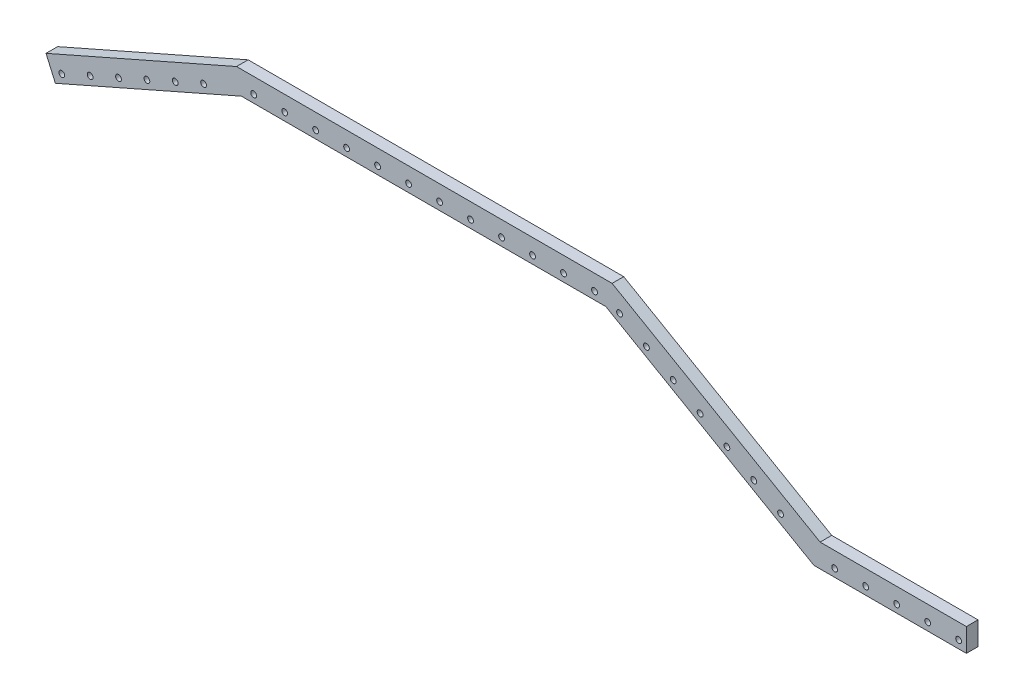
from build123d import *

# Parameters (mm, degrees)
BOSS_EXTRUDE1_DEPTH = 9.525
SKETCH2_R           = 2.38125
CUT_EXTRUDE1_DEPTH  = 792.595599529


with BuildPart() as part:
    # Sketch1 → Boss-Extrude1 (new body)
    with BuildSketch(Plane.XY):
        Polygon((-786.164780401, 23.355998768), (-629.985232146, 92.075), (-322.148522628, 92.075), (-151.671421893, -6.35), (-31.75, -6.35), (-31.75, -25.4), (-151.671421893, -25.4), (-156.775854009, -25.4), (-161.196421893, -22.847783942), (-327.252954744, 73.025), (-625.979535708, 73.025), (-778.492609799, 5.9192474), align=None)
    extrude(amount=BOSS_EXTRUDE1_DEPTH)

    # Sketch2 → Cut-Extrude1 (cut, through all)
    with BuildSketch(Plane(origin=(0, 0, 0), x_dir=(-1, 0, 0), z_dir=(0, 0, -1))):
        with Locations((773.218108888, 15.177529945)):
            Circle(SKETCH2_R)
        with Locations((749.969107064, 25.407090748)):
            Circle(SKETCH2_R)
        with Locations((726.720105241, 35.63665155)):
            Circle(SKETCH2_R)
        with Locations((703.471103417, 45.866212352)):
            Circle(SKETCH2_R)
        with Locations((680.222101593, 56.095773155)):
            Circle(SKETCH2_R)
        with Locations((656.97309977, 66.325333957)):
            Circle(SKETCH2_R)
        with Locations((615.95, 79.375)):
            Circle(SKETCH2_R)
        with Locations((590.55, 79.375)):
            Circle(SKETCH2_R)
        with Locations((565.15, 79.375)):
            Circle(SKETCH2_R)
        with Locations((539.75, 79.375)):
            Circle(SKETCH2_R)
        with Locations((514.35, 79.375)):
            Circle(SKETCH2_R)
        with Locations((488.95, 79.375)):
            Circle(SKETCH2_R)
        with Locations((463.55, 79.375)):
            Circle(SKETCH2_R)
        with Locations((438.15, 79.375)):
            Circle(SKETCH2_R)
        with Locations((412.75, 79.375)):
            Circle(SKETCH2_R)
        with Locations((387.35, 79.375)):
            Circle(SKETCH2_R)
        with Locations((361.95, 79.375)):
            Circle(SKETCH2_R)
        with Locations((336.55, 79.375)):
            Circle(SKETCH2_R)
        with Locations((316.026477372, 73.875738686)):
            Circle(SKETCH2_R)
        with Locations((294.029432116, 61.175738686)):
            Circle(SKETCH2_R)
        with Locations((272.03238686, 48.475738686)):
            Circle(SKETCH2_R)
        with Locations((250.035341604, 35.775738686)):
            Circle(SKETCH2_R)
        with Locations((228.038296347, 23.075738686)):
            Circle(SKETCH2_R)
        with Locations((206.041251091, 10.375738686)):
            Circle(SKETCH2_R)
        with Locations((184.044205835, -2.324261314)):
            Circle(SKETCH2_R)
        with Locations((139.7, -19.05)):
            Circle(SKETCH2_R)
        with Locations((114.3, -19.05)):
            Circle(SKETCH2_R)
        with Locations((88.9, -19.05)):
            Circle(SKETCH2_R)
        with Locations((63.5, -19.05)):
            Circle(SKETCH2_R)
        with Locations((38.1, -19.05)):
            Circle(SKETCH2_R)
    extrude(amount=-CUT_EXTRUDE1_DEPTH, mode=Mode.SUBTRACT)


solid = part.part
